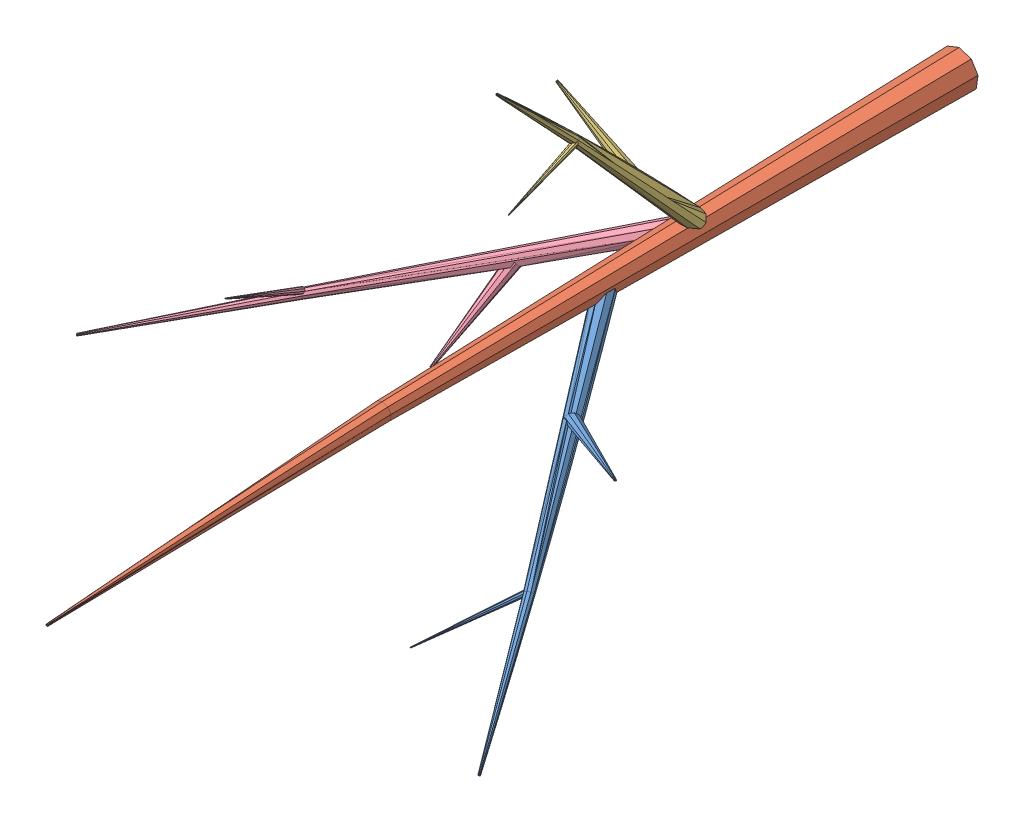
SolidWorks assembly ske23D.sldasm, configuration Default (file format 5000). Lengths in mm.
Overall size (2886.4 3755.53 5969.2).
4 component instances, 4 part files, 0 mates.
Components (placement in the parent):
- trunk#1-1: trunk#1.sldprt [Default] at (784.9948 -772.8956 286.8127) x (-0.353553 0.612372 0.707107) z (0.353553 -0.612372 0.707107) size (412.95 799.64 2417.55)
- trunk-1: trunk.sldprt [Default] at (279.3507 -134.9513 0.0105) size (239.05 254.8 5969.2)
- trunk#1.003-1: trunk#1.003.sldprt [Default] at (335.3171 751.2508 -333.0644) x (-0.473959 -0.546062 0.690781) z (0.191833 0.701616 0.686247) size (412.95 799.64 2477.24)
- trunk#1.006-1: trunk#1.006.sldprt [Default] at (-359.6606 -300.0581 111.819) x (0.866025 0 0.5) z (-0.5 0 0.866025) size (412.95 799.64 2865.24)
